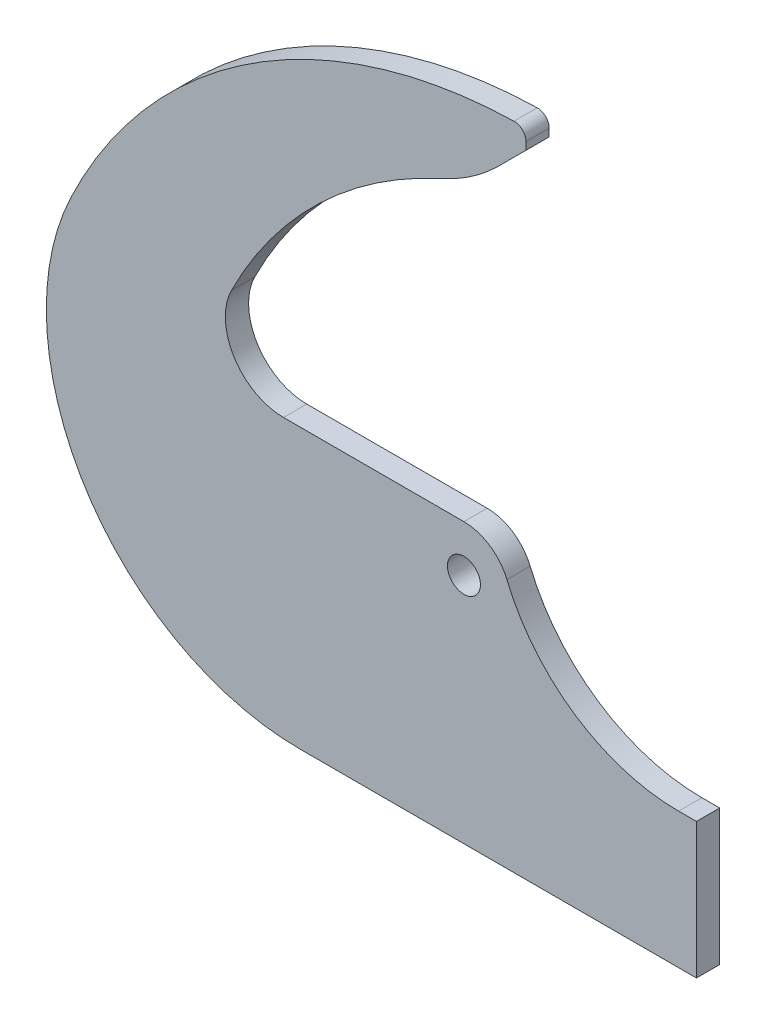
ISO-10303-21;
HEADER;
FILE_DESCRIPTION(('STEP AP214'),'2;1');
FILE_NAME('part.step','',(''),(''),'','','');
FILE_SCHEMA(('AUTOMOTIVE_DESIGN { 1 0 10303 214 1 1 1 1 }'));
ENDSEC;
DATA;
#1=APPLICATION_CONTEXT('core data for automotive mechanical design processes');
#2=APPLICATION_PROTOCOL_DEFINITION('international standard','automotive_design',2000,#1);
#3=PRODUCT_CONTEXT('',#1,'mechanical');
#4=PRODUCT('Part','Part','',(#3));
#5=PRODUCT_RELATED_PRODUCT_CATEGORY('part','',(#4));
#6=PRODUCT_DEFINITION_FORMATION('','',#4);
#7=PRODUCT_DEFINITION_CONTEXT('part definition',#1,'design');
#8=PRODUCT_DEFINITION('design','',#6,#7);
#9=PRODUCT_DEFINITION_SHAPE('','',#8);
#10=(LENGTH_UNIT() NAMED_UNIT(*) SI_UNIT(.MILLI.,.METRE.));
#11=(NAMED_UNIT(*) PLANE_ANGLE_UNIT() SI_UNIT($,.RADIAN.));
#12=(NAMED_UNIT(*) SI_UNIT($,.STERADIAN.) SOLID_ANGLE_UNIT());
#13=UNCERTAINTY_MEASURE_WITH_UNIT(LENGTH_MEASURE(1.E-05),#10,'distance_accuracy_value','');
#14=(GEOMETRIC_REPRESENTATION_CONTEXT(3) GLOBAL_UNCERTAINTY_ASSIGNED_CONTEXT((#13)) GLOBAL_UNIT_ASSIGNED_CONTEXT((#10,
#11,#12)) REPRESENTATION_CONTEXT('',''));
#15=CARTESIAN_POINT('',(0.,0.,0.));
#16=DIRECTION('',(0.,0.,1.));
#17=DIRECTION('',(1.,0.,0.));
#18=AXIS2_PLACEMENT_3D('',#15,#16,#17);
#19=CARTESIAN_POINT('',(0.,2.,6.));
#20=DIRECTION('',(0.,0.,-1.));
#21=DIRECTION('',(-1.,0.,0.));
#22=AXIS2_PLACEMENT_3D('',#19,#20,#21);
#23=PLANE('',#22);
#24=CARTESIAN_POINT('',(40.1891357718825,-16.3566902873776,6.));
#25=DIRECTION('',(0.,0.,-1.));
#26=DIRECTION('',(1.,0.,0.));
#27=AXIS2_PLACEMENT_3D('',#24,#25,#26);
#28=CIRCLE('',#27,112.);
#29=CARTESIAN_POINT('',(-60.,33.704642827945,6.));
#30=VERTEX_POINT('',#29);
#31=CARTESIAN_POINT('',(-5.82974608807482,85.752381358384,6.));
#32=VERTEX_POINT('',#31);
#33=EDGE_CURVE('E161',#30,#32,#28,.T.);
#34=ORIENTED_EDGE('',*,*,#33,.T.);
#35=CARTESIAN_POINT('',(-26.3738897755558,131.336788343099,6.));
#36=DIRECTION('',(0.,0.,-1.));
#37=DIRECTION('',(-1.,0.,0.));
#38=AXIS2_PLACEMENT_3D('',#35,#36,#37);
#39=CIRCLE('',#38,50.);
#40=CARTESIAN_POINT('',(8.98144928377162,95.9814492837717,6.));
#41=VERTEX_POINT('',#40);
#42=EDGE_CURVE('E60',#32,#41,#39,.F.);
#43=ORIENTED_EDGE('',*,*,#42,.T.);
#44=DIRECTION('',(-0.707106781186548,-0.707106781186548,0.));
#45=VECTOR('',#44,1.);
#46=CARTESIAN_POINT('',(1.8923180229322,88.8923180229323,6.));
#47=LINE('',#46,#45);
#48=CARTESIAN_POINT('',(16.,103.,6.));
#49=VERTEX_POINT('',#48);
#50=EDGE_CURVE('E233',#41,#49,#47,.F.);
#51=ORIENTED_EDGE('',*,*,#50,.T.);
#52=DIRECTION('',(0.,1.,0.));
#53=VECTOR('',#52,1.);
#54=CARTESIAN_POINT('',(16.,108.,6.));
#55=LINE('',#54,#53);
#56=CARTESIAN_POINT('',(16.,104.964561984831,6.));
#57=VERTEX_POINT('',#56);
#58=EDGE_CURVE('E163',#49,#57,#55,.T.);
#59=ORIENTED_EDGE('',*,*,#58,.T.);
#60=CARTESIAN_POINT('',(13.,104.964561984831,6.));
#61=DIRECTION('',(0.,0.,-1.));
#62=DIRECTION('',(-1.,0.,0.));
#63=AXIS2_PLACEMENT_3D('',#60,#61,#62);
#64=CIRCLE('',#63,3.);
#65=CARTESIAN_POINT('',(12.9291338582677,107.963724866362,6.));
#66=VERTEX_POINT('',#65);
#67=EDGE_CURVE('E242',#57,#66,#64,.F.);
#68=ORIENTED_EDGE('',*,*,#67,.T.);
#69=CARTESIAN_POINT('',(16.,-22.,6.));
#70=DIRECTION('',(0.,0.,1.));
#71=DIRECTION('',(1.,0.,0.));
#72=AXIS2_PLACEMENT_3D('',#69,#70,#71);
#73=CIRCLE('',#72,130.);
#74=CARTESIAN_POINT('',(-101.460600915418,33.704642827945,6.));
#75=VERTEX_POINT('',#74);
#76=EDGE_CURVE('E182',#66,#75,#73,.T.);
#77=ORIENTED_EDGE('',*,*,#76,.T.);
#78=CARTESIAN_POINT('',(-42.1911960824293,5.59665597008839,6.));
#79=DIRECTION('',(0.,0.,1.));
#80=DIRECTION('',(1.,0.,0.));
#81=AXIS2_PLACEMENT_3D('',#78,#79,#80);
#82=CIRCLE('',#81,65.5966559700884);
#83=CARTESIAN_POINT('',(-42.1911960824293,-60.,6.));
#84=VERTEX_POINT('',#83);
#85=EDGE_CURVE('E146',#75,#84,#82,.T.);
#86=ORIENTED_EDGE('',*,*,#85,.T.);
#87=DIRECTION('',(1.,0.,0.));
#88=VECTOR('',#87,1.);
#89=CARTESIAN_POINT('',(0.,-60.,6.));
#90=LINE('',#89,#88);
#91=CARTESIAN_POINT('',(60.,-60.,6.));
#92=VERTEX_POINT('',#91);
#93=EDGE_CURVE('E215',#84,#92,#90,.T.);
#94=ORIENTED_EDGE('',*,*,#93,.T.);
#95=DIRECTION('',(0.,1.,0.));
#96=VECTOR('',#95,1.);
#97=CARTESIAN_POINT('',(60.,-60.,6.));
#98=LINE('',#97,#96);
#99=CARTESIAN_POINT('',(60.,-25.,6.));
#100=VERTEX_POINT('',#99);
#101=EDGE_CURVE('E212',#92,#100,#98,.T.);
#102=ORIENTED_EDGE('',*,*,#101,.T.);
#103=DIRECTION('',(1.,0.,0.));
#104=VECTOR('',#103,1.);
#105=CARTESIAN_POINT('',(60.,-25.,6.));
#106=LINE('',#105,#104);
#107=CARTESIAN_POINT('',(55.4166040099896,-25.,6.));
#108=VERTEX_POINT('',#107);
#109=EDGE_CURVE('E195',#108,#100,#106,.T.);
#110=ORIENTED_EDGE('',*,*,#109,.F.);
#111=CARTESIAN_POINT('',(55.4166040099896,23.,6.));
#112=DIRECTION('',(0.,0.,-1.));
#113=DIRECTION('',(-1.,0.,0.));
#114=AXIS2_PLACEMENT_3D('',#111,#112,#113);
#115=CIRCLE('',#114,48.);
#116=CARTESIAN_POINT('',(11.0833208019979,4.6,6.));
#117=VERTEX_POINT('',#116);
#118=EDGE_CURVE('E231',#108,#117,#115,.T.);
#119=ORIENTED_EDGE('',*,*,#118,.T.);
#120=CARTESIAN_POINT('',(0.,0.,6.));
#121=DIRECTION('',(0.,0.,1.));
#122=DIRECTION('',(1.,0.,0.));
#123=AXIS2_PLACEMENT_3D('',#120,#121,#122);
#124=CIRCLE('',#123,12.);
#125=CARTESIAN_POINT('',(0.,12.,6.));
#126=VERTEX_POINT('',#125);
#127=EDGE_CURVE('E142',#117,#126,#124,.T.);
#128=ORIENTED_EDGE('',*,*,#127,.T.);
#129=DIRECTION('',(-1.,0.,0.));
#130=VECTOR('',#129,1.);
#131=CARTESIAN_POINT('',(-46.5818121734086,12.,6.));
#132=LINE('',#131,#130);
#133=CARTESIAN_POINT('',(-46.5818121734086,12.,6.));
#134=VERTEX_POINT('',#133);
#135=EDGE_CURVE('E136',#126,#134,#132,.T.);
#136=ORIENTED_EDGE('',*,*,#135,.T.);
#137=CARTESIAN_POINT('',(-46.5818121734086,27.,6.));
#138=DIRECTION('',(0.,0.,-1.));
#139=DIRECTION('',(1.,0.,0.));
#140=AXIS2_PLACEMENT_3D('',#137,#138,#139);
#141=CIRCLE('',#140,15.);
#142=EDGE_CURVE('E139',#134,#30,#141,.T.);
#143=ORIENTED_EDGE('',*,*,#142,.T.);
#144=EDGE_LOOP('',(#34,#43,#51,#59,#68,#77,#86,#94,#102,#110,#119,#128,#136,#143));
#145=FACE_BOUND('',#144,.T.);
#146=CARTESIAN_POINT('',(0.,0.,6.));
#147=DIRECTION('',(0.,0.,1.));
#148=DIRECTION('',(1.,0.,0.));
#149=AXIS2_PLACEMENT_3D('',#146,#147,#148);
#150=CIRCLE('',#149,4.25);
#151=CARTESIAN_POINT('',(4.25,0.,6.));
#152=VERTEX_POINT('',#151);
#153=EDGE_CURVE('E201',#152,#152,#150,.T.);
#154=ORIENTED_EDGE('',*,*,#153,.F.);
#155=EDGE_LOOP('',(#154));
#156=FACE_BOUND('',#155,.T.);
#157=ADVANCED_FACE('F38',(#145,#156),#23,.F.);
#158=CARTESIAN_POINT('',(0.,2.,0.));
#159=DIRECTION('',(0.,0.,-1.));
#160=DIRECTION('',(-1.,0.,0.));
#161=AXIS2_PLACEMENT_3D('',#158,#159,#160);
#162=PLANE('',#161);
#163=DIRECTION('',(0.707106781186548,0.707106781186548,0.));
#164=VECTOR('',#163,1.);
#165=CARTESIAN_POINT('',(-42.5,44.5,0.));
#166=LINE('',#165,#164);
#167=CARTESIAN_POINT('',(16.,103.,0.));
#168=VERTEX_POINT('',#167);
#169=CARTESIAN_POINT('',(8.98144928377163,95.9814492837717,0.));
#170=VERTEX_POINT('',#169);
#171=EDGE_CURVE('E237',#168,#170,#166,.F.);
#172=ORIENTED_EDGE('',*,*,#171,.T.);
#173=CARTESIAN_POINT('',(-26.3738897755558,131.336788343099,0.));
#174=DIRECTION('',(0.,0.,-1.));
#175=DIRECTION('',(-1.,0.,0.));
#176=AXIS2_PLACEMENT_3D('',#173,#174,#175);
#177=CIRCLE('',#176,50.);
#178=CARTESIAN_POINT('',(-5.82974608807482,85.752381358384,0.));
#179=VERTEX_POINT('',#178);
#180=EDGE_CURVE('E11',#170,#179,#177,.T.);
#181=ORIENTED_EDGE('',*,*,#180,.T.);
#182=CARTESIAN_POINT('',(40.1891357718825,-16.3566902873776,0.));
#183=DIRECTION('',(0.,0.,-1.));
#184=DIRECTION('',(1.,0.,0.));
#185=AXIS2_PLACEMENT_3D('',#182,#183,#184);
#186=CIRCLE('',#185,112.);
#187=CARTESIAN_POINT('',(-60.,33.704642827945,0.));
#188=VERTEX_POINT('',#187);
#189=EDGE_CURVE('E155',#188,#179,#186,.T.);
#190=ORIENTED_EDGE('',*,*,#189,.F.);
#191=CARTESIAN_POINT('',(-46.5818121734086,27.,0.));
#192=DIRECTION('',(0.,0.,-1.));
#193=DIRECTION('',(1.,0.,0.));
#194=AXIS2_PLACEMENT_3D('',#191,#192,#193);
#195=CIRCLE('',#194,15.);
#196=CARTESIAN_POINT('',(-46.5818121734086,12.,0.));
#197=VERTEX_POINT('',#196);
#198=EDGE_CURVE('E177',#197,#188,#195,.T.);
#199=ORIENTED_EDGE('',*,*,#198,.F.);
#200=DIRECTION('',(-1.,0.,0.));
#201=VECTOR('',#200,1.);
#202=CARTESIAN_POINT('',(-46.5818121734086,12.,0.));
#203=LINE('',#202,#201);
#204=CARTESIAN_POINT('',(0.,12.,0.));
#205=VERTEX_POINT('',#204);
#206=EDGE_CURVE('E160',#205,#197,#203,.T.);
#207=ORIENTED_EDGE('',*,*,#206,.F.);
#208=CARTESIAN_POINT('',(0.,0.,0.));
#209=DIRECTION('',(0.,0.,1.));
#210=DIRECTION('',(1.,0.,0.));
#211=AXIS2_PLACEMENT_3D('',#208,#209,#210);
#212=CIRCLE('',#211,12.);
#213=CARTESIAN_POINT('',(11.0833208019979,4.6,0.));
#214=VERTEX_POINT('',#213);
#215=EDGE_CURVE('E207',#214,#205,#212,.T.);
#216=ORIENTED_EDGE('',*,*,#215,.F.);
#217=CARTESIAN_POINT('',(55.4166040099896,23.,0.));
#218=DIRECTION('',(0.,0.,-1.));
#219=DIRECTION('',(-1.,0.,0.));
#220=AXIS2_PLACEMENT_3D('',#217,#218,#219);
#221=CIRCLE('',#220,48.);
#222=CARTESIAN_POINT('',(55.4166040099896,-25.,0.));
#223=VERTEX_POINT('',#222);
#224=EDGE_CURVE('E229',#214,#223,#221,.F.);
#225=ORIENTED_EDGE('',*,*,#224,.T.);
#226=DIRECTION('',(1.,0.,0.));
#227=VECTOR('',#226,1.);
#228=CARTESIAN_POINT('',(60.,-25.,0.));
#229=LINE('',#228,#227);
#230=CARTESIAN_POINT('',(60.,-25.,0.));
#231=VERTEX_POINT('',#230);
#232=EDGE_CURVE('E187',#223,#231,#229,.T.);
#233=ORIENTED_EDGE('',*,*,#232,.T.);
#234=DIRECTION('',(0.,1.,0.));
#235=VECTOR('',#234,1.);
#236=CARTESIAN_POINT('',(60.,-60.,0.));
#237=LINE('',#236,#235);
#238=CARTESIAN_POINT('',(60.,-60.,0.));
#239=VERTEX_POINT('',#238);
#240=EDGE_CURVE('E210',#239,#231,#237,.T.);
#241=ORIENTED_EDGE('',*,*,#240,.F.);
#242=DIRECTION('',(1.,0.,0.));
#243=VECTOR('',#242,1.);
#244=CARTESIAN_POINT('',(0.,-60.,0.));
#245=LINE('',#244,#243);
#246=CARTESIAN_POINT('',(-42.1911960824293,-60.,0.));
#247=VERTEX_POINT('',#246);
#248=EDGE_CURVE('E216',#247,#239,#245,.T.);
#249=ORIENTED_EDGE('',*,*,#248,.F.);
#250=CARTESIAN_POINT('',(-42.1911960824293,5.59665597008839,0.));
#251=DIRECTION('',(0.,0.,1.));
#252=DIRECTION('',(1.,0.,0.));
#253=AXIS2_PLACEMENT_3D('',#250,#251,#252);
#254=CIRCLE('',#253,65.5966559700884);
#255=CARTESIAN_POINT('',(-101.460600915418,33.704642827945,0.));
#256=VERTEX_POINT('',#255);
#257=EDGE_CURVE('E173',#256,#247,#254,.T.);
#258=ORIENTED_EDGE('',*,*,#257,.F.);
#259=CARTESIAN_POINT('',(16.,-22.,0.));
#260=DIRECTION('',(0.,0.,1.));
#261=DIRECTION('',(1.,0.,0.));
#262=AXIS2_PLACEMENT_3D('',#259,#260,#261);
#263=CIRCLE('',#262,130.);
#264=CARTESIAN_POINT('',(12.9291338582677,107.963724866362,0.));
#265=VERTEX_POINT('',#264);
#266=EDGE_CURVE('E171',#265,#256,#263,.T.);
#267=ORIENTED_EDGE('',*,*,#266,.F.);
#268=CARTESIAN_POINT('',(13.,104.964561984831,0.));
#269=DIRECTION('',(0.,0.,-1.));
#270=DIRECTION('',(-1.,0.,0.));
#271=AXIS2_PLACEMENT_3D('',#268,#269,#270);
#272=CIRCLE('',#271,3.);
#273=CARTESIAN_POINT('',(16.,104.964561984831,0.));
#274=VERTEX_POINT('',#273);
#275=EDGE_CURVE('E246',#265,#274,#272,.T.);
#276=ORIENTED_EDGE('',*,*,#275,.T.);
#277=DIRECTION('',(0.,1.,0.));
#278=VECTOR('',#277,1.);
#279=CARTESIAN_POINT('',(16.,108.,0.));
#280=LINE('',#279,#278);
#281=EDGE_CURVE('E168',#168,#274,#280,.T.);
#282=ORIENTED_EDGE('',*,*,#281,.F.);
#283=EDGE_LOOP('',(#172,#181,#190,#199,#207,#216,#225,#233,#241,#249,#258,#267,#276,#282));
#284=FACE_BOUND('',#283,.T.);
#285=CARTESIAN_POINT('',(0.,0.,0.));
#286=DIRECTION('',(0.,0.,-1.));
#287=DIRECTION('',(-1.,0.,0.));
#288=AXIS2_PLACEMENT_3D('',#285,#286,#287);
#289=CIRCLE('',#288,4.25);
#290=CARTESIAN_POINT('',(-4.25,0.,0.));
#291=VERTEX_POINT('',#290);
#292=EDGE_CURVE('E204',#291,#291,#289,.T.);
#293=ORIENTED_EDGE('',*,*,#292,.F.);
#294=EDGE_LOOP('',(#293));
#295=FACE_BOUND('',#294,.T.);
#296=ADVANCED_FACE('F258',(#284,#295),#162,.T.);
#297=CARTESIAN_POINT('',(60.,-60.,6.));
#298=DIRECTION('',(-1.,0.,0.));
#299=DIRECTION('',(0.,-1.,0.));
#300=AXIS2_PLACEMENT_3D('',#297,#298,#299);
#301=PLANE('',#300);
#302=ORIENTED_EDGE('',*,*,#240,.T.);
#303=DIRECTION('',(0.,0.,-1.));
#304=VECTOR('',#303,1.);
#305=CARTESIAN_POINT('',(60.,-25.,6.));
#306=LINE('',#305,#304);
#307=EDGE_CURVE('E197',#100,#231,#306,.T.);
#308=ORIENTED_EDGE('',*,*,#307,.F.);
#309=ORIENTED_EDGE('',*,*,#101,.F.);
#310=DIRECTION('',(0.,0.,-1.));
#311=VECTOR('',#310,1.);
#312=CARTESIAN_POINT('',(60.,-60.,6.));
#313=LINE('',#312,#311);
#314=EDGE_CURVE('E218',#92,#239,#313,.T.);
#315=ORIENTED_EDGE('',*,*,#314,.T.);
#316=EDGE_LOOP('',(#302,#308,#309,#315));
#317=FACE_BOUND('',#316,.T.);
#318=ADVANCED_FACE('F289',(#317),#301,.F.);
#319=CARTESIAN_POINT('',(0.,-60.,6.));
#320=DIRECTION('',(0.,1.,0.));
#321=DIRECTION('',(0.,0.,1.));
#322=AXIS2_PLACEMENT_3D('',#319,#320,#321);
#323=PLANE('',#322);
#324=ORIENTED_EDGE('',*,*,#248,.T.);
#325=ORIENTED_EDGE('',*,*,#314,.F.);
#326=ORIENTED_EDGE('',*,*,#93,.F.);
#327=DIRECTION('',(0.,0.,1.));
#328=VECTOR('',#327,1.);
#329=CARTESIAN_POINT('',(-42.1911960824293,-60.,0.));
#330=LINE('',#329,#328);
#331=EDGE_CURVE('E190',#247,#84,#330,.T.);
#332=ORIENTED_EDGE('',*,*,#331,.F.);
#333=EDGE_LOOP('',(#324,#325,#326,#332));
#334=FACE_BOUND('',#333,.T.);
#335=ADVANCED_FACE('F286',(#334),#323,.F.);
#336=CARTESIAN_POINT('',(0.,0.,0.));
#337=DIRECTION('',(0.,0.,1.));
#338=DIRECTION('',(1.,0.,0.));
#339=AXIS2_PLACEMENT_3D('',#336,#337,#338);
#340=CYLINDRICAL_SURFACE('',#339,12.);
#341=DIRECTION('',(0.,0.,1.));
#342=VECTOR('',#341,1.);
#343=CARTESIAN_POINT('',(0.,12.,0.));
#344=LINE('',#343,#342);
#345=EDGE_CURVE('E188',#205,#126,#344,.T.);
#346=ORIENTED_EDGE('',*,*,#345,.T.);
#347=ORIENTED_EDGE('',*,*,#127,.F.);
#348=DIRECTION('',(0.,0.,1.));
#349=VECTOR('',#348,1.);
#350=CARTESIAN_POINT('',(11.0833208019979,4.6,0.));
#351=LINE('',#350,#349);
#352=EDGE_CURVE('E224',#117,#214,#351,.F.);
#353=ORIENTED_EDGE('',*,*,#352,.T.);
#354=ORIENTED_EDGE('',*,*,#215,.T.);
#355=EDGE_LOOP('',(#346,#347,#353,#354));
#356=FACE_BOUND('',#355,.T.);
#357=ADVANCED_FACE('F300',(#356),#340,.T.);
#358=CARTESIAN_POINT('',(0.,0.,6.));
#359=DIRECTION('',(0.,0.,1.));
#360=DIRECTION('',(1.,0.,0.));
#361=AXIS2_PLACEMENT_3D('',#358,#359,#360);
#362=CYLINDRICAL_SURFACE('',#361,4.25);
#363=ORIENTED_EDGE('',*,*,#292,.T.);
#364=EDGE_LOOP('',(#363));
#365=FACE_BOUND('',#364,.T.);
#366=ORIENTED_EDGE('',*,*,#153,.T.);
#367=EDGE_LOOP('',(#366));
#368=FACE_BOUND('',#367,.T.);
#369=ADVANCED_FACE('F302',(#365,#368),#362,.F.);
#370=CARTESIAN_POINT('',(60.,-25.,6.));
#371=DIRECTION('',(0.,1.,0.));
#372=DIRECTION('',(0.,0.,1.));
#373=AXIS2_PLACEMENT_3D('',#370,#371,#372);
#374=PLANE('',#373);
#375=ORIENTED_EDGE('',*,*,#232,.F.);
#376=DIRECTION('',(0.,0.,-1.));
#377=VECTOR('',#376,1.);
#378=CARTESIAN_POINT('',(55.4166040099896,-25.,6.));
#379=LINE('',#378,#377);
#380=EDGE_CURVE('E227',#223,#108,#379,.F.);
#381=ORIENTED_EDGE('',*,*,#380,.T.);
#382=ORIENTED_EDGE('',*,*,#109,.T.);
#383=ORIENTED_EDGE('',*,*,#307,.T.);
#384=EDGE_LOOP('',(#375,#381,#382,#383));
#385=FACE_BOUND('',#384,.T.);
#386=ADVANCED_FACE('F292',(#385),#374,.T.);
#387=CARTESIAN_POINT('',(55.4166040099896,23.,0.));
#388=DIRECTION('',(0.,0.,1.));
#389=DIRECTION('',(1.,0.,0.));
#390=AXIS2_PLACEMENT_3D('',#387,#388,#389);
#391=CYLINDRICAL_SURFACE('',#390,48.);
#392=ORIENTED_EDGE('',*,*,#118,.F.);
#393=ORIENTED_EDGE('',*,*,#380,.F.);
#394=ORIENTED_EDGE('',*,*,#224,.F.);
#395=ORIENTED_EDGE('',*,*,#352,.F.);
#396=EDGE_LOOP('',(#392,#393,#394,#395));
#397=FACE_BOUND('',#396,.T.);
#398=ADVANCED_FACE('F297',(#397),#391,.F.);
#399=CARTESIAN_POINT('',(-46.5818121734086,12.,0.));
#400=DIRECTION('',(0.,1.,0.));
#401=DIRECTION('',(-1.,0.,0.));
#402=AXIS2_PLACEMENT_3D('',#399,#400,#401);
#403=PLANE('',#402);
#404=ORIENTED_EDGE('',*,*,#206,.T.);
#405=DIRECTION('',(0.,0.,1.));
#406=VECTOR('',#405,1.);
#407=CARTESIAN_POINT('',(-46.5818121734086,12.,-4.));
#408=LINE('',#407,#406);
#409=EDGE_CURVE('E151',#197,#134,#408,.T.);
#410=ORIENTED_EDGE('',*,*,#409,.T.);
#411=ORIENTED_EDGE('',*,*,#135,.F.);
#412=ORIENTED_EDGE('',*,*,#345,.F.);
#413=EDGE_LOOP('',(#404,#410,#411,#412));
#414=FACE_BOUND('',#413,.T.);
#415=ADVANCED_FACE('F158',(#414),#403,.T.);
#416=CARTESIAN_POINT('',(-46.5818121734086,27.,0.));
#417=DIRECTION('',(0.,0.,1.));
#418=DIRECTION('',(1.,0.,0.));
#419=AXIS2_PLACEMENT_3D('',#416,#417,#418);
#420=CYLINDRICAL_SURFACE('',#419,15.);
#421=ORIENTED_EDGE('',*,*,#142,.F.);
#422=ORIENTED_EDGE('',*,*,#409,.F.);
#423=ORIENTED_EDGE('',*,*,#198,.T.);
#424=DIRECTION('',(0.,0.,1.));
#425=VECTOR('',#424,1.);
#426=CARTESIAN_POINT('',(-60.,33.704642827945,0.));
#427=LINE('',#426,#425);
#428=EDGE_CURVE('E153',#188,#30,#427,.T.);
#429=ORIENTED_EDGE('',*,*,#428,.T.);
#430=EDGE_LOOP('',(#421,#422,#423,#429));
#431=FACE_BOUND('',#430,.T.);
#432=ADVANCED_FACE('F150',(#431),#420,.F.);
#433=CARTESIAN_POINT('',(40.1891357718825,-16.3566902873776,0.));
#434=DIRECTION('',(0.,0.,1.));
#435=DIRECTION('',(1.,0.,0.));
#436=AXIS2_PLACEMENT_3D('',#433,#434,#435);
#437=CYLINDRICAL_SURFACE('',#436,112.);
#438=ORIENTED_EDGE('',*,*,#189,.T.);
#439=DIRECTION('',(0.,0.,1.));
#440=VECTOR('',#439,1.);
#441=CARTESIAN_POINT('',(-5.82974608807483,85.752381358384,0.));
#442=LINE('',#441,#440);
#443=EDGE_CURVE('E248',#179,#32,#442,.T.);
#444=ORIENTED_EDGE('',*,*,#443,.T.);
#445=ORIENTED_EDGE('',*,*,#33,.F.);
#446=ORIENTED_EDGE('',*,*,#428,.F.);
#447=EDGE_LOOP('',(#438,#444,#445,#446));
#448=FACE_BOUND('',#447,.T.);
#449=ADVANCED_FACE('F253',(#448),#437,.F.);
#450=CARTESIAN_POINT('',(-42.1911960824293,5.59665597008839,0.));
#451=DIRECTION('',(0.,0.,1.));
#452=DIRECTION('',(1.,0.,0.));
#453=AXIS2_PLACEMENT_3D('',#450,#451,#452);
#454=CYLINDRICAL_SURFACE('',#453,65.5966559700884);
#455=ORIENTED_EDGE('',*,*,#85,.F.);
#456=DIRECTION('',(0.,0.,1.));
#457=VECTOR('',#456,1.);
#458=CARTESIAN_POINT('',(-101.460600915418,33.704642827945,0.));
#459=LINE('',#458,#457);
#460=EDGE_CURVE('E178',#256,#75,#459,.T.);
#461=ORIENTED_EDGE('',*,*,#460,.F.);
#462=ORIENTED_EDGE('',*,*,#257,.T.);
#463=ORIENTED_EDGE('',*,*,#331,.T.);
#464=EDGE_LOOP('',(#455,#461,#462,#463));
#465=FACE_BOUND('',#464,.T.);
#466=ADVANCED_FACE('F279',(#465),#454,.T.);
#467=CARTESIAN_POINT('',(16.,-22.,0.));
#468=DIRECTION('',(0.,0.,1.));
#469=DIRECTION('',(1.,0.,0.));
#470=AXIS2_PLACEMENT_3D('',#467,#468,#469);
#471=CYLINDRICAL_SURFACE('',#470,130.);
#472=ORIENTED_EDGE('',*,*,#76,.F.);
#473=DIRECTION('',(0.,0.,1.));
#474=VECTOR('',#473,1.);
#475=CARTESIAN_POINT('',(12.9291338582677,107.963724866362,0.));
#476=LINE('',#475,#474);
#477=EDGE_CURVE('E244',#66,#265,#476,.F.);
#478=ORIENTED_EDGE('',*,*,#477,.T.);
#479=ORIENTED_EDGE('',*,*,#266,.T.);
#480=ORIENTED_EDGE('',*,*,#460,.T.);
#481=EDGE_LOOP('',(#472,#478,#479,#480));
#482=FACE_BOUND('',#481,.T.);
#483=ADVANCED_FACE('F271',(#482),#471,.T.);
#484=CARTESIAN_POINT('',(16.,108.,0.));
#485=DIRECTION('',(1.,0.,0.));
#486=DIRECTION('',(0.,1.,0.));
#487=AXIS2_PLACEMENT_3D('',#484,#485,#486);
#488=PLANE('',#487);
#489=ORIENTED_EDGE('',*,*,#281,.T.);
#490=DIRECTION('',(0.,0.,1.));
#491=VECTOR('',#490,1.);
#492=CARTESIAN_POINT('',(16.,104.964561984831,0.));
#493=LINE('',#492,#491);
#494=EDGE_CURVE('E239',#274,#57,#493,.T.);
#495=ORIENTED_EDGE('',*,*,#494,.T.);
#496=ORIENTED_EDGE('',*,*,#58,.F.);
#497=DIRECTION('',(0.,0.,-1.));
#498=VECTOR('',#497,1.);
#499=CARTESIAN_POINT('',(16.,103.,0.));
#500=LINE('',#499,#498);
#501=EDGE_CURVE('E235',#49,#168,#500,.T.);
#502=ORIENTED_EDGE('',*,*,#501,.T.);
#503=EDGE_LOOP('',(#489,#495,#496,#502));
#504=FACE_BOUND('',#503,.T.);
#505=ADVANCED_FACE('F265',(#504),#488,.T.);
#506=CARTESIAN_POINT('',(1.8923180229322,88.8923180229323,0.));
#507=DIRECTION('',(-0.707106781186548,0.707106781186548,0.));
#508=DIRECTION('',(-0.707106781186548,-0.707106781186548,0.));
#509=AXIS2_PLACEMENT_3D('',#506,#507,#508);
#510=PLANE('',#509);
#511=ORIENTED_EDGE('',*,*,#50,.F.);
#512=DIRECTION('',(0.,0.,-1.));
#513=VECTOR('',#512,1.);
#514=CARTESIAN_POINT('',(8.98144928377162,95.9814492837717,0.));
#515=LINE('',#514,#513);
#516=EDGE_CURVE('E46',#41,#170,#515,.T.);
#517=ORIENTED_EDGE('',*,*,#516,.T.);
#518=ORIENTED_EDGE('',*,*,#171,.F.);
#519=ORIENTED_EDGE('',*,*,#501,.F.);
#520=EDGE_LOOP('',(#511,#517,#518,#519));
#521=FACE_BOUND('',#520,.T.);
#522=ADVANCED_FACE('F262',(#521),#510,.F.);
#523=CARTESIAN_POINT('',(13.,104.964561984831,0.));
#524=DIRECTION('',(0.,0.,1.));
#525=DIRECTION('',(1.,0.,0.));
#526=AXIS2_PLACEMENT_3D('',#523,#524,#525);
#527=CYLINDRICAL_SURFACE('',#526,3.);
#528=ORIENTED_EDGE('',*,*,#275,.F.);
#529=ORIENTED_EDGE('',*,*,#477,.F.);
#530=ORIENTED_EDGE('',*,*,#67,.F.);
#531=ORIENTED_EDGE('',*,*,#494,.F.);
#532=EDGE_LOOP('',(#528,#529,#530,#531));
#533=FACE_BOUND('',#532,.T.);
#534=ADVANCED_FACE('F276',(#533),#527,.T.);
#535=CARTESIAN_POINT('',(-26.3738897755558,131.336788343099,0.));
#536=DIRECTION('',(0.,0.,1.));
#537=DIRECTION('',(1.,0.,0.));
#538=AXIS2_PLACEMENT_3D('',#535,#536,#537);
#539=CYLINDRICAL_SURFACE('',#538,50.);
#540=ORIENTED_EDGE('',*,*,#180,.F.);
#541=ORIENTED_EDGE('',*,*,#516,.F.);
#542=ORIENTED_EDGE('',*,*,#42,.F.);
#543=ORIENTED_EDGE('',*,*,#443,.F.);
#544=EDGE_LOOP('',(#540,#541,#542,#543));
#545=FACE_BOUND('',#544,.T.);
#546=ADVANCED_FACE('F40',(#545),#539,.T.);
#547=CLOSED_SHELL('',(#157,#296,#318,#335,#357,#369,#386,#398,#415,#432,#449,#466,#483,#505,
#522,#534,#546));
#548=MANIFOLD_SOLID_BREP('B2',#547);
#549=ADVANCED_BREP_SHAPE_REPRESENTATION('',(#18,#548),#14);
#550=SHAPE_DEFINITION_REPRESENTATION(#9,#549);
ENDSEC;
END-ISO-10303-21;
